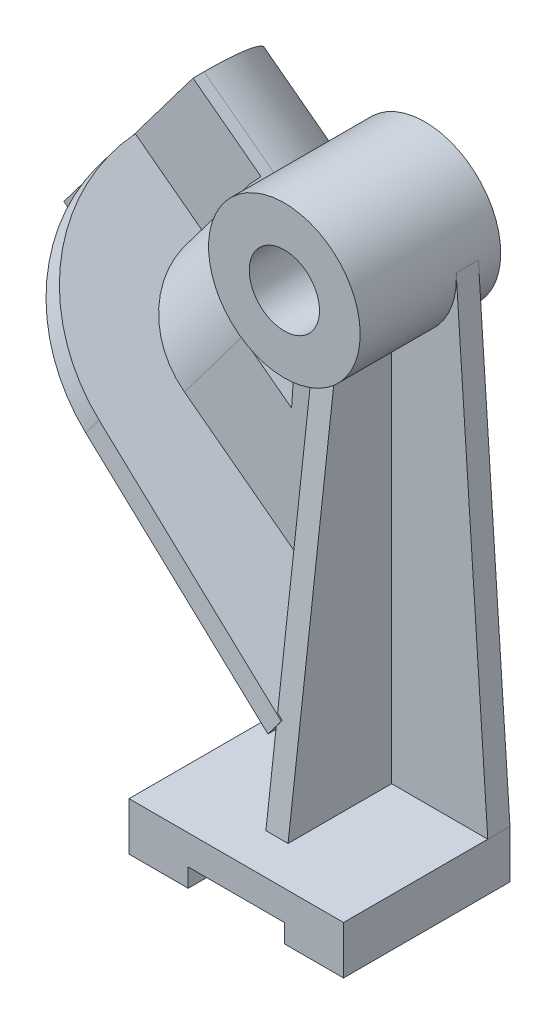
ISO-10303-21;
HEADER;
FILE_DESCRIPTION(('STEP AP214'),'2;1');
FILE_NAME('part.step','',(''),(''),'','','');
FILE_SCHEMA(('AUTOMOTIVE_DESIGN { 1 0 10303 214 1 1 1 1 }'));
ENDSEC;
DATA;
#1=APPLICATION_CONTEXT('core data for automotive mechanical design processes');
#2=APPLICATION_PROTOCOL_DEFINITION('international standard','automotive_design',2000,#1);
#3=PRODUCT_CONTEXT('',#1,'mechanical');
#4=PRODUCT('Part','Part','',(#3));
#5=PRODUCT_RELATED_PRODUCT_CATEGORY('part','',(#4));
#6=PRODUCT_DEFINITION_FORMATION('','',#4);
#7=PRODUCT_DEFINITION_CONTEXT('part definition',#1,'design');
#8=PRODUCT_DEFINITION('design','',#6,#7);
#9=PRODUCT_DEFINITION_SHAPE('','',#8);
#10=(LENGTH_UNIT() NAMED_UNIT(*) SI_UNIT(.MILLI.,.METRE.));
#11=(NAMED_UNIT(*) PLANE_ANGLE_UNIT() SI_UNIT($,.RADIAN.));
#12=(NAMED_UNIT(*) SI_UNIT($,.STERADIAN.) SOLID_ANGLE_UNIT());
#13=UNCERTAINTY_MEASURE_WITH_UNIT(LENGTH_MEASURE(1.E-05),#10,'distance_accuracy_value','');
#14=(GEOMETRIC_REPRESENTATION_CONTEXT(3) GLOBAL_UNCERTAINTY_ASSIGNED_CONTEXT((#13)) GLOBAL_UNIT_ASSIGNED_CONTEXT((#10,
#11,#12)) REPRESENTATION_CONTEXT('',''));
#15=CARTESIAN_POINT('',(0.,0.,0.));
#16=DIRECTION('',(0.,0.,1.));
#17=DIRECTION('',(1.,0.,0.));
#18=AXIS2_PLACEMENT_3D('',#15,#16,#17);
#19=CARTESIAN_POINT('',(0.,140.,6.));
#20=DIRECTION('',(0.,0.,1.));
#21=DIRECTION('',(1.,0.,0.));
#22=AXIS2_PLACEMENT_3D('',#19,#20,#21);
#23=PLANE('',#22);
#24=DIRECTION('',(-0.798635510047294,0.601815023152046,0.));
#25=VECTOR('',#24,1.);
#26=CARTESIAN_POINT('',(-49.6220556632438,74.1493079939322,6.));
#27=LINE('',#26,#25);
#28=CARTESIAN_POINT('',(-3.,39.0170691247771,6.));
#29=VERTEX_POINT('',#28);
#30=CARTESIAN_POINT('',(-53.0204802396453,76.7102045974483,5.99999999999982));
#31=VERTEX_POINT('',#30);
#32=EDGE_CURVE('E287',#29,#31,#27,.T.);
#33=ORIENTED_EDGE('',*,*,#32,.F.);
#34=DIRECTION('',(0.,1.,0.));
#35=VECTOR('',#34,1.);
#36=CARTESIAN_POINT('',(-3.,140.,6.));
#37=LINE('',#36,#35);
#38=CARTESIAN_POINT('',(-3.,119.720700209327,6.));
#39=VERTEX_POINT('',#38);
#40=EDGE_CURVE('E366',#29,#39,#37,.T.);
#41=ORIENTED_EDGE('',*,*,#40,.T.);
#42=CARTESIAN_POINT('',(0.,140.,6.));
#43=DIRECTION('',(0.,0.,-1.));
#44=DIRECTION('',(1.,0.,0.));
#45=AXIS2_PLACEMENT_3D('',#42,#43,#44);
#46=CIRCLE('',#45,20.5);
#47=CARTESIAN_POINT('',(-20.4547243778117,141.361708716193,6.));
#48=VERTEX_POINT('',#47);
#49=EDGE_CURVE('E443',#39,#48,#46,.T.);
#50=ORIENTED_EDGE('',*,*,#49,.T.);
#51=DIRECTION('',(-0.0664248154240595,-0.997791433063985,0.));
#52=VECTOR('',#51,1.);
#53=CARTESIAN_POINT('',(-29.,13.,6.));
#54=LINE('',#53,#52);
#55=CARTESIAN_POINT('',(-24.0449825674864,87.4311280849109,6.));
#56=VERTEX_POINT('',#55);
#57=EDGE_CURVE('E418',#48,#56,#54,.T.);
#58=ORIENTED_EDGE('',*,*,#57,.T.);
#59=DIRECTION('',(-0.798635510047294,0.601815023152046,0.));
#60=VECTOR('',#59,1.);
#61=CARTESIAN_POINT('',(17.4526356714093,56.1604297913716,5.9999999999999));
#62=LINE('',#61,#60);
#63=CARTESIAN_POINT('',(-37.373289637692,97.474727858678,5.99999999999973));
#64=VERTEX_POINT('',#63);
#65=EDGE_CURVE('E324',#56,#64,#62,.T.);
#66=ORIENTED_EDGE('',*,*,#65,.T.);
#67=DIRECTION('',(-0.601815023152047,-0.798635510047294,0.));
#68=VECTOR('',#67,1.);
#69=CARTESIAN_POINT('',(-37.373289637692,97.474727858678,5.99999999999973));
#70=LINE('',#69,#68);
#71=EDGE_CURVE('E347',#64,#31,#70,.T.);
#72=ORIENTED_EDGE('',*,*,#71,.T.);
#73=EDGE_LOOP('',(#33,#41,#50,#58,#66,#72));
#74=FACE_BOUND('',#73,.T.);
#75=ADVANCED_FACE('F33',(#74),#23,.T.);
#76=CARTESIAN_POINT('',(-3.,80.25,19.5000125));
#77=DIRECTION('',(1.,0.,0.));
#78=DIRECTION('',(0.,0.,-1.));
#79=AXIS2_PLACEMENT_3D('',#76,#77,#78);
#80=PLANE('',#79);
#81=DIRECTION('',(0.,-0.99263221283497,0.121166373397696));
#82=VECTOR('',#81,1.);
#83=CARTESIAN_POINT('',(-3.,119.5,21.));
#84=LINE('',#83,#82);
#85=CARTESIAN_POINT('',(-3.,36.0791819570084,31.1828228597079));
#86=VERTEX_POINT('',#85);
#87=CARTESIAN_POINT('',(-3.,13.,34.));
#88=VERTEX_POINT('',#87);
#89=EDGE_CURVE('E356',#86,#88,#84,.T.);
#90=ORIENTED_EDGE('',*,*,#89,.F.);
#91=DIRECTION('',(0.,0.,1.));
#92=VECTOR('',#91,1.);
#93=CARTESIAN_POINT('',(-3.,36.0791819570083,19.5000125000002));
#94=LINE('',#93,#92);
#95=CARTESIAN_POINT('',(-3.,36.0791819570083,6.));
#96=VERTEX_POINT('',#95);
#97=EDGE_CURVE('E11',#86,#96,#94,.F.);
#98=ORIENTED_EDGE('',*,*,#97,.T.);
#99=CARTESIAN_POINT('',(-3.,13.,6.));
#100=VERTEX_POINT('',#99);
#101=EDGE_CURVE('E367',#100,#96,#37,.T.);
#102=ORIENTED_EDGE('',*,*,#101,.F.);
#103=DIRECTION('',(0.,0.,1.));
#104=VECTOR('',#103,1.);
#105=CARTESIAN_POINT('',(-3.,13.,45.));
#106=LINE('',#105,#104);
#107=EDGE_CURVE('E370',#100,#88,#106,.T.);
#108=ORIENTED_EDGE('',*,*,#107,.T.);
#109=EDGE_LOOP('',(#90,#98,#102,#108));
#110=FACE_BOUND('',#109,.T.);
#111=ADVANCED_FACE('F534',(#110),#80,.F.);
#112=CARTESIAN_POINT('',(-37.373289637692,97.4747278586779,-19.0000000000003));
#113=DIRECTION('',(-0.601815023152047,-0.798635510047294,0.));
#114=DIRECTION('',(0.798635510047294,-0.601815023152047,0.));
#115=AXIS2_PLACEMENT_3D('',#112,#113,#114);
#116=CYLINDRICAL_SURFACE('',#115,25.);
#117=CARTESIAN_POINT('',(-56.6313703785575,71.9183915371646,5.99999999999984));
#118=VERTEX_POINT('',#117);
#119=CARTESIAN_POINT('',(-72.2785609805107,51.1538682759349,5.99999999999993));
#120=VERTEX_POINT('',#119);
#121=EDGE_CURVE('E346',#118,#120,#70,.T.);
#122=ORIENTED_EDGE('',*,*,#121,.F.);
#123=CARTESIAN_POINT('',(-56.6313703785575,71.9183915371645,-19.0000000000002));
#124=DIRECTION('',(0.601815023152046,0.798635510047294,0.));
#125=DIRECTION('',(-0.798635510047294,0.601815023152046,0.));
#126=AXIS2_PLACEMENT_3D('',#123,#124,#125);
#127=CIRCLE('',#126,25.);
#128=CARTESIAN_POINT('',(-76.5972581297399,86.9637671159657,-19.0000000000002));
#129=VERTEX_POINT('',#128);
#130=EDGE_CURVE('E277',#118,#129,#127,.F.);
#131=ORIENTED_EDGE('',*,*,#130,.T.);
#132=DIRECTION('',(-0.601815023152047,-0.798635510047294,0.));
#133=VECTOR('',#132,1.);
#134=CARTESIAN_POINT('',(-57.3391773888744,112.520103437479,-19.0000000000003));
#135=LINE('',#134,#133);
#136=CARTESIAN_POINT('',(-92.2444487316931,66.199243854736,-19.0000000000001));
#137=VERTEX_POINT('',#136);
#138=EDGE_CURVE('E350',#129,#137,#135,.T.);
#139=ORIENTED_EDGE('',*,*,#138,.T.);
#140=CARTESIAN_POINT('',(-72.2785609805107,51.1538682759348,-19.0000000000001));
#141=DIRECTION('',(0.601815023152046,0.798635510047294,0.));
#142=DIRECTION('',(-0.798635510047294,0.601815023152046,0.));
#143=AXIS2_PLACEMENT_3D('',#140,#141,#142);
#144=CIRCLE('',#143,25.);
#145=EDGE_CURVE('E332',#120,#137,#144,.F.);
#146=ORIENTED_EDGE('',*,*,#145,.F.);
#147=EDGE_LOOP('',(#122,#131,#139,#146));
#148=FACE_BOUND('',#147,.T.);
#149=ADVANCED_FACE('F624',(#148),#116,.T.);
#150=CARTESIAN_POINT('',(-74.7918130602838,89.3596736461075,-21.9999999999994));
#151=DIRECTION('',(0.798635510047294,-0.601815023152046,0.));
#152=DIRECTION('',(0.601815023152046,0.798635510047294,0.));
#153=AXIS2_PLACEMENT_3D('',#150,#151,#152);
#154=CYLINDRICAL_SURFACE('',#153,29.);
#155=DIRECTION('',(0.798635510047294,-0.601815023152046,0.));
#156=VECTOR('',#155,1.);
#157=CARTESIAN_POINT('',(-37.373289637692,97.4747278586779,-21.9999999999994));
#158=LINE('',#157,#156);
#159=CARTESIAN_POINT('',(-52.5473643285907,108.909213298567,-21.9999999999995));
#160=VERTEX_POINT('',#159);
#161=CARTESIAN_POINT('',(-75.7077941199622,126.361848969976,-21.9999999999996));
#162=VERTEX_POINT('',#161);
#163=EDGE_CURVE('E506',#160,#162,#158,.F.);
#164=ORIENTED_EDGE('',*,*,#163,.F.);
#165=CARTESIAN_POINT('',(-70.,85.7487835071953,-21.9999999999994));
#166=DIRECTION('',(-0.798635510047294,0.601815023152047,0.));
#167=DIRECTION('',(-0.601815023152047,-0.798635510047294,0.));
#168=AXIS2_PLACEMENT_3D('',#165,#166,#167);
#169=CIRCLE('',#168,29.);
#170=CARTESIAN_POINT('',(-87.4526356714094,62.5883537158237,-21.9999999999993));
#171=VERTEX_POINT('',#170);
#172=EDGE_CURVE('E41',#171,#160,#169,.F.);
#173=ORIENTED_EDGE('',*,*,#172,.F.);
#174=DIRECTION('',(-0.798635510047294,0.601815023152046,0.));
#175=VECTOR('',#174,1.);
#176=CARTESIAN_POINT('',(-92.2444487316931,66.199243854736,-21.9999999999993));
#177=LINE('',#176,#175);
#178=CARTESIAN_POINT('',(-110.613065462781,80.0409893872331,-21.9999999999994));
#179=VERTEX_POINT('',#178);
#180=EDGE_CURVE('E501',#179,#171,#177,.F.);
#181=ORIENTED_EDGE('',*,*,#180,.F.);
#182=CARTESIAN_POINT('',(-93.1604297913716,103.201419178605,-21.9999999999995));
#183=DIRECTION('',(0.798635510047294,-0.601815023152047,0.));
#184=DIRECTION('',(0.601815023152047,0.798635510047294,0.));
#185=AXIS2_PLACEMENT_3D('',#182,#183,#184);
#186=CIRCLE('',#185,29.);
#187=EDGE_CURVE('E305',#179,#162,#186,.T.);
#188=ORIENTED_EDGE('',*,*,#187,.T.);
#189=EDGE_LOOP('',(#164,#173,#181,#188));
#190=FACE_BOUND('',#189,.T.);
#191=ADVANCED_FACE('F35',(#190),#154,.T.);
#192=CARTESIAN_POINT('',(-29.,13.,6.));
#193=DIRECTION('',(0.997791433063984,-0.0664248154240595,0.));
#194=DIRECTION('',(0.0664248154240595,0.997791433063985,0.));
#195=AXIS2_PLACEMENT_3D('',#192,#193,#194);
#196=PLANE('',#195);
#197=DIRECTION('',(0.,0.,1.));
#198=VECTOR('',#197,1.);
#199=CARTESIAN_POINT('',(-28.6487377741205,18.2764382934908,5.99999999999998));
#200=LINE('',#199,#198);
#201=CARTESIAN_POINT('',(-28.6487377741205,18.2764382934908,0.));
#202=VERTEX_POINT('',#201);
#203=CARTESIAN_POINT('',(-28.6487377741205,18.2764382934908,6.00000000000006));
#204=VERTEX_POINT('',#203);
#205=EDGE_CURVE('E419',#202,#204,#200,.T.);
#206=ORIENTED_EDGE('',*,*,#205,.F.);
#207=DIRECTION('',(-0.0664248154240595,-0.997791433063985,0.));
#208=VECTOR('',#207,1.);
#209=CARTESIAN_POINT('',(-29.,13.,0.));
#210=LINE('',#209,#208);
#211=CARTESIAN_POINT('',(-29.,13.,0.));
#212=VERTEX_POINT('',#211);
#213=EDGE_CURVE('E604',#202,#212,#210,.T.);
#214=ORIENTED_EDGE('',*,*,#213,.T.);
#215=DIRECTION('',(0.,0.,-1.));
#216=VECTOR('',#215,1.);
#217=CARTESIAN_POINT('',(-29.,13.,6.));
#218=LINE('',#217,#216);
#219=CARTESIAN_POINT('',(-29.,13.,6.00000000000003));
#220=VERTEX_POINT('',#219);
#221=EDGE_CURVE('E424',#220,#212,#218,.T.);
#222=ORIENTED_EDGE('',*,*,#221,.F.);
#223=EDGE_CURVE('E415',#204,#220,#54,.T.);
#224=ORIENTED_EDGE('',*,*,#223,.F.);
#225=EDGE_LOOP('',(#206,#214,#222,#224));
#226=FACE_BOUND('',#225,.T.);
#227=ADVANCED_FACE('F608',(#226),#196,.F.);
#228=DIRECTION('',(-0.601815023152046,-0.798635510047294,0.));
#229=VECTOR('',#228,1.);
#230=CARTESIAN_POINT('',(48.0340948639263,103.803713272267,6.));
#231=LINE('',#230,#229);
#232=CARTESIAN_POINT('',(-5.19885093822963,33.161208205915,6.));
#233=VERTEX_POINT('',#232);
#234=EDGE_CURVE('E297',#233,#96,#231,.F.);
#235=ORIENTED_EDGE('',*,*,#234,.F.);
#236=DIRECTION('',(-0.798635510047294,0.601815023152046,0.));
#237=VECTOR('',#236,1.);
#238=CARTESIAN_POINT('',(-53.2329458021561,69.3574949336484,6.));
#239=LINE('',#238,#237);
#240=EDGE_CURVE('E280',#233,#118,#239,.T.);
#241=ORIENTED_EDGE('',*,*,#240,.T.);
#242=ORIENTED_EDGE('',*,*,#121,.T.);
#243=DIRECTION('',(-0.798635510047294,0.601815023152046,0.));
#244=VECTOR('',#243,1.);
#245=CARTESIAN_POINT('',(-17.4526356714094,9.8395702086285,6.0000000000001));
#246=LINE('',#245,#244);
#247=EDGE_CURVE('E335',#204,#120,#246,.T.);
#248=ORIENTED_EDGE('',*,*,#247,.F.);
#249=ORIENTED_EDGE('',*,*,#223,.T.);
#250=DIRECTION('',(1.,0.,0.));
#251=VECTOR('',#250,1.);
#252=CARTESIAN_POINT('',(29.,13.,6.));
#253=LINE('',#252,#251);
#254=EDGE_CURVE('E405',#220,#100,#253,.T.);
#255=ORIENTED_EDGE('',*,*,#254,.T.);
#256=ORIENTED_EDGE('',*,*,#101,.T.);
#257=EDGE_LOOP('',(#235,#241,#242,#248,#249,#255,#256));
#258=FACE_BOUND('',#257,.T.);
#259=ADVANCED_FACE('F527',(#258),#23,.T.);
#260=CARTESIAN_POINT('',(-29.,13.,45.));
#261=DIRECTION('',(0.,-1.,0.));
#262=DIRECTION('',(0.,0.,-1.));
#263=AXIS2_PLACEMENT_3D('',#260,#261,#262);
#264=PLANE('',#263);
#265=CARTESIAN_POINT('',(3.,13.,6.));
#266=VERTEX_POINT('',#265);
#267=CARTESIAN_POINT('',(29.,13.,6.));
#268=VERTEX_POINT('',#267);
#269=EDGE_CURVE('E409',#266,#268,#253,.T.);
#270=ORIENTED_EDGE('',*,*,#269,.F.);
#271=DIRECTION('',(0.,0.,1.));
#272=VECTOR('',#271,1.);
#273=CARTESIAN_POINT('',(3.,13.,45.));
#274=LINE('',#273,#272);
#275=CARTESIAN_POINT('',(3.,13.,34.));
#276=VERTEX_POINT('',#275);
#277=EDGE_CURVE('E377',#266,#276,#274,.T.);
#278=ORIENTED_EDGE('',*,*,#277,.T.);
#279=DIRECTION('',(-1.,0.,0.));
#280=VECTOR('',#279,1.);
#281=CARTESIAN_POINT('',(-29.,13.,34.));
#282=LINE('',#281,#280);
#283=EDGE_CURVE('E383',#276,#88,#282,.T.);
#284=ORIENTED_EDGE('',*,*,#283,.T.);
#285=ORIENTED_EDGE('',*,*,#107,.F.);
#286=ORIENTED_EDGE('',*,*,#254,.F.);
#287=DIRECTION('',(0.,0.,-1.));
#288=VECTOR('',#287,1.);
#289=CARTESIAN_POINT('',(-29.,13.,45.));
#290=LINE('',#289,#288);
#291=CARTESIAN_POINT('',(-29.,13.,45.));
#292=VERTEX_POINT('',#291);
#293=EDGE_CURVE('E476',#292,#220,#290,.T.);
#294=ORIENTED_EDGE('',*,*,#293,.F.);
#295=DIRECTION('',(-1.,0.,0.));
#296=VECTOR('',#295,1.);
#297=CARTESIAN_POINT('',(-29.,13.,45.));
#298=LINE('',#297,#296);
#299=CARTESIAN_POINT('',(29.,13.,45.));
#300=VERTEX_POINT('',#299);
#301=EDGE_CURVE('E550',#300,#292,#298,.T.);
#302=ORIENTED_EDGE('',*,*,#301,.F.);
#303=DIRECTION('',(0.,0.,-1.));
#304=VECTOR('',#303,1.);
#305=CARTESIAN_POINT('',(29.,13.,45.));
#306=LINE('',#305,#304);
#307=EDGE_CURVE('E470',#300,#268,#306,.T.);
#308=ORIENTED_EDGE('',*,*,#307,.T.);
#309=EDGE_LOOP('',(#270,#278,#284,#285,#286,#294,#302,#308));
#310=FACE_BOUND('',#309,.T.);
#311=ADVANCED_FACE('F537',(#310),#264,.F.);
#312=CARTESIAN_POINT('',(-29.,0.,45.));
#313=DIRECTION('',(1.,0.,0.));
#314=DIRECTION('',(0.,0.,-1.));
#315=AXIS2_PLACEMENT_3D('',#312,#313,#314);
#316=PLANE('',#315);
#317=DIRECTION('',(0.,-1.,0.));
#318=VECTOR('',#317,1.);
#319=CARTESIAN_POINT('',(-29.,0.,0.));
#320=LINE('',#319,#318);
#321=CARTESIAN_POINT('',(-29.,0.,0.));
#322=VERTEX_POINT('',#321);
#323=EDGE_CURVE('E561',#212,#322,#320,.T.);
#324=ORIENTED_EDGE('',*,*,#323,.T.);
#325=DIRECTION('',(0.,0.,-1.));
#326=VECTOR('',#325,1.);
#327=CARTESIAN_POINT('',(-29.,0.,45.));
#328=LINE('',#327,#326);
#329=CARTESIAN_POINT('',(-29.,0.,45.));
#330=VERTEX_POINT('',#329);
#331=EDGE_CURVE('E496',#330,#322,#328,.T.);
#332=ORIENTED_EDGE('',*,*,#331,.F.);
#333=DIRECTION('',(0.,-1.,0.));
#334=VECTOR('',#333,1.);
#335=CARTESIAN_POINT('',(-29.,0.,45.));
#336=LINE('',#335,#334);
#337=EDGE_CURVE('E567',#292,#330,#336,.T.);
#338=ORIENTED_EDGE('',*,*,#337,.F.);
#339=ORIENTED_EDGE('',*,*,#293,.T.);
#340=ORIENTED_EDGE('',*,*,#221,.T.);
#341=EDGE_LOOP('',(#324,#332,#338,#339,#340));
#342=FACE_BOUND('',#341,.T.);
#343=ADVANCED_FACE('F829',(#342),#316,.F.);
#344=CARTESIAN_POINT('',(-29.,0.,45.));
#345=DIRECTION('',(0.,1.,0.));
#346=DIRECTION('',(0.,0.,1.));
#347=AXIS2_PLACEMENT_3D('',#344,#345,#346);
#348=PLANE('',#347);
#349=DIRECTION('',(1.,0.,0.));
#350=VECTOR('',#349,1.);
#351=CARTESIAN_POINT('',(-29.,0.,0.));
#352=LINE('',#351,#350);
#353=CARTESIAN_POINT('',(-13.,0.,0.));
#354=VERTEX_POINT('',#353);
#355=EDGE_CURVE('E584',#322,#354,#352,.T.);
#356=ORIENTED_EDGE('',*,*,#355,.T.);
#357=DIRECTION('',(0.,0.,-1.));
#358=VECTOR('',#357,1.);
#359=CARTESIAN_POINT('',(-13.,0.,45.));
#360=LINE('',#359,#358);
#361=CARTESIAN_POINT('',(-13.,0.,45.));
#362=VERTEX_POINT('',#361);
#363=EDGE_CURVE('E494',#362,#354,#360,.T.);
#364=ORIENTED_EDGE('',*,*,#363,.F.);
#365=DIRECTION('',(1.,0.,0.));
#366=VECTOR('',#365,1.);
#367=CARTESIAN_POINT('',(-29.,0.,45.));
#368=LINE('',#367,#366);
#369=EDGE_CURVE('E570',#330,#362,#368,.T.);
#370=ORIENTED_EDGE('',*,*,#369,.F.);
#371=ORIENTED_EDGE('',*,*,#331,.T.);
#372=EDGE_LOOP('',(#356,#364,#370,#371));
#373=FACE_BOUND('',#372,.T.);
#374=ADVANCED_FACE('F908',(#373),#348,.F.);
#375=CARTESIAN_POINT('',(-13.,0.,45.));
#376=DIRECTION('',(-1.,0.,0.));
#377=DIRECTION('',(0.,0.,1.));
#378=AXIS2_PLACEMENT_3D('',#375,#376,#377);
#379=PLANE('',#378);
#380=DIRECTION('',(0.,1.,0.));
#381=VECTOR('',#380,1.);
#382=CARTESIAN_POINT('',(-13.,0.,0.));
#383=LINE('',#382,#381);
#384=CARTESIAN_POINT('',(-13.,5.,0.));
#385=VERTEX_POINT('',#384);
#386=EDGE_CURVE('E586',#354,#385,#383,.T.);
#387=ORIENTED_EDGE('',*,*,#386,.T.);
#388=DIRECTION('',(0.,0.,-1.));
#389=VECTOR('',#388,1.);
#390=CARTESIAN_POINT('',(-13.,5.,45.));
#391=LINE('',#390,#389);
#392=CARTESIAN_POINT('',(-13.,5.,45.));
#393=VERTEX_POINT('',#392);
#394=EDGE_CURVE('E491',#393,#385,#391,.T.);
#395=ORIENTED_EDGE('',*,*,#394,.F.);
#396=DIRECTION('',(0.,1.,0.));
#397=VECTOR('',#396,1.);
#398=CARTESIAN_POINT('',(-13.,0.,45.));
#399=LINE('',#398,#397);
#400=EDGE_CURVE('E572',#362,#393,#399,.T.);
#401=ORIENTED_EDGE('',*,*,#400,.F.);
#402=ORIENTED_EDGE('',*,*,#363,.T.);
#403=EDGE_LOOP('',(#387,#395,#401,#402));
#404=FACE_BOUND('',#403,.T.);
#405=ADVANCED_FACE('F872',(#404),#379,.F.);
#406=CARTESIAN_POINT('',(-13.,5.,45.));
#407=DIRECTION('',(0.,1.,0.));
#408=DIRECTION('',(0.,0.,1.));
#409=AXIS2_PLACEMENT_3D('',#406,#407,#408);
#410=PLANE('',#409);
#411=DIRECTION('',(1.,0.,0.));
#412=VECTOR('',#411,1.);
#413=CARTESIAN_POINT('',(-13.,5.,0.));
#414=LINE('',#413,#412);
#415=CARTESIAN_POINT('',(13.,5.,0.));
#416=VERTEX_POINT('',#415);
#417=EDGE_CURVE('E588',#385,#416,#414,.T.);
#418=ORIENTED_EDGE('',*,*,#417,.T.);
#419=DIRECTION('',(0.,0.,-1.));
#420=VECTOR('',#419,1.);
#421=CARTESIAN_POINT('',(13.,5.,45.));
#422=LINE('',#421,#420);
#423=CARTESIAN_POINT('',(13.,5.,45.));
#424=VERTEX_POINT('',#423);
#425=EDGE_CURVE('E488',#424,#416,#422,.T.);
#426=ORIENTED_EDGE('',*,*,#425,.F.);
#427=DIRECTION('',(1.,0.,0.));
#428=VECTOR('',#427,1.);
#429=CARTESIAN_POINT('',(-13.,5.,45.));
#430=LINE('',#429,#428);
#431=EDGE_CURVE('E574',#393,#424,#430,.T.);
#432=ORIENTED_EDGE('',*,*,#431,.F.);
#433=ORIENTED_EDGE('',*,*,#394,.T.);
#434=EDGE_LOOP('',(#418,#426,#432,#433));
#435=FACE_BOUND('',#434,.T.);
#436=ADVANCED_FACE('F866',(#435),#410,.F.);
#437=CARTESIAN_POINT('',(13.,0.,45.));
#438=DIRECTION('',(1.,0.,0.));
#439=DIRECTION('',(0.,0.,-1.));
#440=AXIS2_PLACEMENT_3D('',#437,#438,#439);
#441=PLANE('',#440);
#442=DIRECTION('',(0.,-1.,0.));
#443=VECTOR('',#442,1.);
#444=CARTESIAN_POINT('',(13.,0.,0.));
#445=LINE('',#444,#443);
#446=CARTESIAN_POINT('',(13.,0.,0.));
#447=VERTEX_POINT('',#446);
#448=EDGE_CURVE('E590',#416,#447,#445,.T.);
#449=ORIENTED_EDGE('',*,*,#448,.T.);
#450=DIRECTION('',(0.,0.,-1.));
#451=VECTOR('',#450,1.);
#452=CARTESIAN_POINT('',(13.,0.,45.));
#453=LINE('',#452,#451);
#454=CARTESIAN_POINT('',(13.,0.,45.));
#455=VERTEX_POINT('',#454);
#456=EDGE_CURVE('E485',#455,#447,#453,.T.);
#457=ORIENTED_EDGE('',*,*,#456,.F.);
#458=DIRECTION('',(0.,-1.,0.));
#459=VECTOR('',#458,1.);
#460=CARTESIAN_POINT('',(13.,0.,45.));
#461=LINE('',#460,#459);
#462=EDGE_CURVE('E576',#424,#455,#461,.T.);
#463=ORIENTED_EDGE('',*,*,#462,.F.);
#464=ORIENTED_EDGE('',*,*,#425,.T.);
#465=EDGE_LOOP('',(#449,#457,#463,#464));
#466=FACE_BOUND('',#465,.T.);
#467=ADVANCED_FACE('F871',(#466),#441,.F.);
#468=CARTESIAN_POINT('',(13.,0.,45.));
#469=DIRECTION('',(0.,1.,0.));
#470=DIRECTION('',(0.,0.,1.));
#471=AXIS2_PLACEMENT_3D('',#468,#469,#470);
#472=PLANE('',#471);
#473=DIRECTION('',(1.,0.,0.));
#474=VECTOR('',#473,1.);
#475=CARTESIAN_POINT('',(13.,0.,0.));
#476=LINE('',#475,#474);
#477=CARTESIAN_POINT('',(29.,0.,0.));
#478=VERTEX_POINT('',#477);
#479=EDGE_CURVE('E592',#447,#478,#476,.T.);
#480=ORIENTED_EDGE('',*,*,#479,.T.);
#481=DIRECTION('',(0.,0.,-1.));
#482=VECTOR('',#481,1.);
#483=CARTESIAN_POINT('',(29.,0.,45.));
#484=LINE('',#483,#482);
#485=CARTESIAN_POINT('',(29.,0.,45.));
#486=VERTEX_POINT('',#485);
#487=EDGE_CURVE('E475',#486,#478,#484,.T.);
#488=ORIENTED_EDGE('',*,*,#487,.F.);
#489=DIRECTION('',(1.,0.,0.));
#490=VECTOR('',#489,1.);
#491=CARTESIAN_POINT('',(13.,0.,45.));
#492=LINE('',#491,#490);
#493=EDGE_CURVE('E578',#455,#486,#492,.T.);
#494=ORIENTED_EDGE('',*,*,#493,.F.);
#495=ORIENTED_EDGE('',*,*,#456,.T.);
#496=EDGE_LOOP('',(#480,#488,#494,#495));
#497=FACE_BOUND('',#496,.T.);
#498=ADVANCED_FACE('F596',(#497),#472,.F.);
#499=CARTESIAN_POINT('',(29.,0.,45.));
#500=DIRECTION('',(-1.,0.,0.));
#501=DIRECTION('',(0.,0.,1.));
#502=AXIS2_PLACEMENT_3D('',#499,#500,#501);
#503=PLANE('',#502);
#504=DIRECTION('',(0.,1.,0.));
#505=VECTOR('',#504,1.);
#506=CARTESIAN_POINT('',(29.,0.,0.));
#507=LINE('',#506,#505);
#508=CARTESIAN_POINT('',(29.,13.,0.));
#509=VERTEX_POINT('',#508);
#510=EDGE_CURVE('E557',#478,#509,#507,.T.);
#511=ORIENTED_EDGE('',*,*,#510,.T.);
#512=DIRECTION('',(0.,0.,-1.));
#513=VECTOR('',#512,1.);
#514=CARTESIAN_POINT('',(29.,13.,6.));
#515=LINE('',#514,#513);
#516=EDGE_CURVE('E554',#268,#509,#515,.T.);
#517=ORIENTED_EDGE('',*,*,#516,.F.);
#518=ORIENTED_EDGE('',*,*,#307,.F.);
#519=DIRECTION('',(0.,1.,0.));
#520=VECTOR('',#519,1.);
#521=CARTESIAN_POINT('',(29.,0.,45.));
#522=LINE('',#521,#520);
#523=EDGE_CURVE('E580',#486,#300,#522,.T.);
#524=ORIENTED_EDGE('',*,*,#523,.F.);
#525=ORIENTED_EDGE('',*,*,#487,.T.);
#526=EDGE_LOOP('',(#511,#517,#518,#524,#525));
#527=FACE_BOUND('',#526,.T.);
#528=ADVANCED_FACE('F555',(#527),#503,.F.);
#529=CARTESIAN_POINT('',(-29.,13.,45.));
#530=DIRECTION('',(0.,0.,-1.));
#531=DIRECTION('',(-1.,0.,0.));
#532=AXIS2_PLACEMENT_3D('',#529,#530,#531);
#533=PLANE('',#532);
#534=ORIENTED_EDGE('',*,*,#337,.T.);
#535=ORIENTED_EDGE('',*,*,#369,.T.);
#536=ORIENTED_EDGE('',*,*,#400,.T.);
#537=ORIENTED_EDGE('',*,*,#431,.T.);
#538=ORIENTED_EDGE('',*,*,#462,.T.);
#539=ORIENTED_EDGE('',*,*,#493,.T.);
#540=ORIENTED_EDGE('',*,*,#523,.T.);
#541=ORIENTED_EDGE('',*,*,#301,.T.);
#542=EDGE_LOOP('',(#534,#535,#536,#537,#538,#539,#540,#541));
#543=FACE_BOUND('',#542,.T.);
#544=ADVANCED_FACE('F747',(#543),#533,.F.);
#545=CARTESIAN_POINT('',(-29.,13.,0.));
#546=DIRECTION('',(0.,0.,-1.));
#547=DIRECTION('',(-1.,0.,0.));
#548=AXIS2_PLACEMENT_3D('',#545,#546,#547);
#549=PLANE('',#548);
#550=DIRECTION('',(-0.798635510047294,0.601815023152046,0.));
#551=VECTOR('',#550,1.);
#552=CARTESIAN_POINT('',(-17.4526356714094,9.83957020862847,1.01253017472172E-13));
#553=LINE('',#552,#551);
#554=CARTESIAN_POINT('',(-72.2785609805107,51.1538682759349,0.));
#555=VERTEX_POINT('',#554);
#556=EDGE_CURVE('E338',#202,#555,#553,.T.);
#557=ORIENTED_EDGE('',*,*,#556,.T.);
#558=DIRECTION('',(-0.601815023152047,-0.798635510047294,0.));
#559=VECTOR('',#558,1.);
#560=CARTESIAN_POINT('',(-37.373289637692,97.474727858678,-2.80424297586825E-13));
#561=LINE('',#560,#559);
#562=CARTESIAN_POINT('',(-37.373289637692,97.474727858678,-2.80424297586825E-13));
#563=VERTEX_POINT('',#562);
#564=EDGE_CURVE('E344',#563,#555,#561,.T.);
#565=ORIENTED_EDGE('',*,*,#564,.F.);
#566=DIRECTION('',(-0.798635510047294,0.601815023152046,0.));
#567=VECTOR('',#566,1.);
#568=CARTESIAN_POINT('',(17.4526356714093,56.1604297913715,-1.01253017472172E-13));
#569=LINE('',#568,#567);
#570=CARTESIAN_POINT('',(-24.0449825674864,87.4311280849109,0.));
#571=VERTEX_POINT('',#570);
#572=EDGE_CURVE('E326',#571,#563,#569,.T.);
#573=ORIENTED_EDGE('',*,*,#572,.F.);
#574=CARTESIAN_POINT('',(-20.4547243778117,141.361708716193,0.));
#575=VERTEX_POINT('',#574);
#576=EDGE_CURVE('E412',#575,#571,#210,.T.);
#577=ORIENTED_EDGE('',*,*,#576,.F.);
#578=CARTESIAN_POINT('',(0.,140.,0.));
#579=DIRECTION('',(0.,0.,-1.));
#580=DIRECTION('',(1.,0.,0.));
#581=AXIS2_PLACEMENT_3D('',#578,#579,#580);
#582=CIRCLE('',#581,20.5);
#583=CARTESIAN_POINT('',(20.4547243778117,141.361708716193,0.));
#584=VERTEX_POINT('',#583);
#585=EDGE_CURVE('E603',#584,#575,#582,.T.);
#586=ORIENTED_EDGE('',*,*,#585,.F.);
#587=DIRECTION('',(-0.0664248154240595,0.997791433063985,0.));
#588=VECTOR('',#587,1.);
#589=CARTESIAN_POINT('',(20.4547243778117,141.361708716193,0.));
#590=LINE('',#589,#588);
#591=EDGE_CURVE('E398',#509,#584,#590,.T.);
#592=ORIENTED_EDGE('',*,*,#591,.F.);
#593=ORIENTED_EDGE('',*,*,#510,.F.);
#594=ORIENTED_EDGE('',*,*,#479,.F.);
#595=ORIENTED_EDGE('',*,*,#448,.F.);
#596=ORIENTED_EDGE('',*,*,#417,.F.);
#597=ORIENTED_EDGE('',*,*,#386,.F.);
#598=ORIENTED_EDGE('',*,*,#355,.F.);
#599=ORIENTED_EDGE('',*,*,#323,.F.);
#600=ORIENTED_EDGE('',*,*,#213,.F.);
#601=EDGE_LOOP('',(#557,#565,#573,#577,#586,#592,#593,#594,#595,#596,#597,#598,#599,#600));
#602=FACE_BOUND('',#601,.T.);
#603=ADVANCED_FACE('F601',(#602),#549,.T.);
#604=CARTESIAN_POINT('',(20.4547243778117,141.361708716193,6.));
#605=DIRECTION('',(-0.997791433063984,-0.0664248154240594,0.));
#606=DIRECTION('',(0.0664248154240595,-0.997791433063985,0.));
#607=AXIS2_PLACEMENT_3D('',#604,#605,#606);
#608=PLANE('',#607);
#609=ORIENTED_EDGE('',*,*,#591,.T.);
#610=DIRECTION('',(0.,0.,-1.));
#611=VECTOR('',#610,1.);
#612=CARTESIAN_POINT('',(20.4547243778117,141.361708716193,6.));
#613=LINE('',#612,#611);
#614=CARTESIAN_POINT('',(20.4547243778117,141.361708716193,6.));
#615=VERTEX_POINT('',#614);
#616=EDGE_CURVE('E434',#615,#584,#613,.T.);
#617=ORIENTED_EDGE('',*,*,#616,.F.);
#618=DIRECTION('',(-0.0664248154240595,0.997791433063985,0.));
#619=VECTOR('',#618,1.);
#620=CARTESIAN_POINT('',(20.4547243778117,141.361708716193,6.));
#621=LINE('',#620,#619);
#622=EDGE_CURVE('E462',#268,#615,#621,.T.);
#623=ORIENTED_EDGE('',*,*,#622,.F.);
#624=ORIENTED_EDGE('',*,*,#516,.T.);
#625=EDGE_LOOP('',(#609,#617,#623,#624));
#626=FACE_BOUND('',#625,.T.);
#627=ADVANCED_FACE('F562',(#626),#608,.F.);
#628=ORIENTED_EDGE('',*,*,#576,.T.);
#629=DIRECTION('',(0.,0.,1.));
#630=VECTOR('',#629,1.);
#631=CARTESIAN_POINT('',(-24.0449825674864,87.4311280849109,5.99999999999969));
#632=LINE('',#631,#630);
#633=EDGE_CURVE('E354',#571,#56,#632,.T.);
#634=ORIENTED_EDGE('',*,*,#633,.T.);
#635=ORIENTED_EDGE('',*,*,#57,.F.);
#636=DIRECTION('',(0.,0.,-1.));
#637=VECTOR('',#636,1.);
#638=CARTESIAN_POINT('',(-20.4547243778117,141.361708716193,6.));
#639=LINE('',#638,#637);
#640=EDGE_CURVE('E427',#48,#575,#639,.T.);
#641=ORIENTED_EDGE('',*,*,#640,.T.);
#642=EDGE_LOOP('',(#628,#634,#635,#641));
#643=FACE_BOUND('',#642,.T.);
#644=ADVANCED_FACE('F637',(#643),#196,.F.);
#645=CARTESIAN_POINT('',(3.,119.720700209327,6.));
#646=VERTEX_POINT('',#645);
#647=EDGE_CURVE('E401',#615,#646,#46,.T.);
#648=ORIENTED_EDGE('',*,*,#647,.T.);
#649=DIRECTION('',(0.,1.,0.));
#650=VECTOR('',#649,1.);
#651=CARTESIAN_POINT('',(3.,140.,6.));
#652=LINE('',#651,#650);
#653=EDGE_CURVE('E375',#266,#646,#652,.T.);
#654=ORIENTED_EDGE('',*,*,#653,.F.);
#655=ORIENTED_EDGE('',*,*,#269,.T.);
#656=ORIENTED_EDGE('',*,*,#622,.T.);
#657=EDGE_LOOP('',(#648,#654,#655,#656));
#658=FACE_BOUND('',#657,.T.);
#659=ADVANCED_FACE('F546',(#658),#23,.T.);
#660=CARTESIAN_POINT('',(0.,140.,-6.));
#661=DIRECTION('',(0.,0.,1.));
#662=DIRECTION('',(1.,0.,0.));
#663=AXIS2_PLACEMENT_3D('',#660,#661,#662);
#664=CYLINDRICAL_SURFACE('',#663,20.5);
#665=CARTESIAN_POINT('',(0.,140.,-6.));
#666=DIRECTION('',(0.,0.,1.));
#667=DIRECTION('',(1.,0.,0.));
#668=AXIS2_PLACEMENT_3D('',#665,#666,#667);
#669=CIRCLE('',#668,20.5);
#670=CARTESIAN_POINT('',(20.5,140.,-6.));
#671=VERTEX_POINT('',#670);
#672=EDGE_CURVE('E395',#671,#671,#669,.T.);
#673=ORIENTED_EDGE('',*,*,#672,.T.);
#674=EDGE_LOOP('',(#673));
#675=FACE_BOUND('',#674,.T.);
#676=ORIENTED_EDGE('',*,*,#585,.T.);
#677=ORIENTED_EDGE('',*,*,#640,.F.);
#678=ORIENTED_EDGE('',*,*,#49,.F.);
#679=DIRECTION('',(0.,0.,1.));
#680=VECTOR('',#679,1.);
#681=CARTESIAN_POINT('',(-3.,119.720700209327,-6.));
#682=LINE('',#681,#680);
#683=CARTESIAN_POINT('',(-3.,119.720700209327,20.9730600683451));
#684=VERTEX_POINT('',#683);
#685=EDGE_CURVE('E360',#39,#684,#682,.T.);
#686=ORIENTED_EDGE('',*,*,#685,.T.);
#687=CARTESIAN_POINT('',(0.,140.,18.4976525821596));
#688=DIRECTION('',(0.,0.121166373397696,0.99263221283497));
#689=DIRECTION('',(0.,-0.99263221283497,0.121166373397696));
#690=AXIS2_PLACEMENT_3D('',#687,#688,#689);
#691=ELLIPSE('',#690,20.6521607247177,20.5);
#692=CARTESIAN_POINT('',(3.,119.720700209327,20.9730600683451));
#693=VERTEX_POINT('',#692);
#694=EDGE_CURVE('E380',#693,#684,#691,.F.);
#695=ORIENTED_EDGE('',*,*,#694,.F.);
#696=DIRECTION('',(0.,0.,1.));
#697=VECTOR('',#696,1.);
#698=CARTESIAN_POINT('',(3.,119.720700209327,-6.));
#699=LINE('',#698,#697);
#700=EDGE_CURVE('E373',#646,#693,#699,.T.);
#701=ORIENTED_EDGE('',*,*,#700,.F.);
#702=ORIENTED_EDGE('',*,*,#647,.F.);
#703=ORIENTED_EDGE('',*,*,#616,.T.);
#704=EDGE_LOOP('',(#676,#677,#678,#686,#695,#701,#702,#703));
#705=FACE_BOUND('',#704,.T.);
#706=CARTESIAN_POINT('',(0.,140.,32.));
#707=DIRECTION('',(0.,0.,1.));
#708=DIRECTION('',(1.,0.,0.));
#709=AXIS2_PLACEMENT_3D('',#706,#707,#708);
#710=CIRCLE('',#709,20.5);
#711=CARTESIAN_POINT('',(20.5,140.,32.));
#712=VERTEX_POINT('',#711);
#713=EDGE_CURVE('E389',#712,#712,#710,.T.);
#714=ORIENTED_EDGE('',*,*,#713,.F.);
#715=EDGE_LOOP('',(#714));
#716=FACE_BOUND('',#715,.T.);
#717=ADVANCED_FACE('F460',(#675,#705,#716),#664,.T.);
#718=CARTESIAN_POINT('',(0.,140.,-6.));
#719=DIRECTION('',(0.,0.,1.));
#720=DIRECTION('',(1.,0.,0.));
#721=AXIS2_PLACEMENT_3D('',#718,#719,#720);
#722=PLANE('',#721);
#723=CARTESIAN_POINT('',(0.,140.,-6.));
#724=DIRECTION('',(0.,0.,1.));
#725=DIRECTION('',(1.,0.,0.));
#726=AXIS2_PLACEMENT_3D('',#723,#724,#725);
#727=CIRCLE('',#726,9.5);
#728=CARTESIAN_POINT('',(9.5,140.,-6.));
#729=VERTEX_POINT('',#728);
#730=EDGE_CURVE('E392',#729,#729,#727,.T.);
#731=ORIENTED_EDGE('',*,*,#730,.T.);
#732=EDGE_LOOP('',(#731));
#733=FACE_BOUND('',#732,.T.);
#734=ORIENTED_EDGE('',*,*,#672,.F.);
#735=EDGE_LOOP('',(#734));
#736=FACE_BOUND('',#735,.T.);
#737=ADVANCED_FACE('F642',(#733,#736),#722,.F.);
#738=CARTESIAN_POINT('',(0.,140.,-6.));
#739=DIRECTION('',(0.,0.,1.));
#740=DIRECTION('',(1.,0.,0.));
#741=AXIS2_PLACEMENT_3D('',#738,#739,#740);
#742=CYLINDRICAL_SURFACE('',#741,9.5);
#743=ORIENTED_EDGE('',*,*,#730,.F.);
#744=EDGE_LOOP('',(#743));
#745=FACE_BOUND('',#744,.T.);
#746=CARTESIAN_POINT('',(0.,140.,32.));
#747=DIRECTION('',(0.,0.,1.));
#748=DIRECTION('',(1.,0.,0.));
#749=AXIS2_PLACEMENT_3D('',#746,#747,#748);
#750=CIRCLE('',#749,9.5);
#751=CARTESIAN_POINT('',(9.5,140.,32.));
#752=VERTEX_POINT('',#751);
#753=EDGE_CURVE('E386',#752,#752,#750,.T.);
#754=ORIENTED_EDGE('',*,*,#753,.T.);
#755=EDGE_LOOP('',(#754));
#756=FACE_BOUND('',#755,.T.);
#757=ADVANCED_FACE('F841',(#745,#756),#742,.F.);
#758=CARTESIAN_POINT('',(0.,140.,32.));
#759=DIRECTION('',(0.,0.,1.));
#760=DIRECTION('',(1.,0.,0.));
#761=AXIS2_PLACEMENT_3D('',#758,#759,#760);
#762=PLANE('',#761);
#763=ORIENTED_EDGE('',*,*,#713,.T.);
#764=EDGE_LOOP('',(#763));
#765=FACE_BOUND('',#764,.T.);
#766=ORIENTED_EDGE('',*,*,#753,.F.);
#767=EDGE_LOOP('',(#766));
#768=FACE_BOUND('',#767,.T.);
#769=ADVANCED_FACE('F759',(#765,#768),#762,.T.);
#770=CARTESIAN_POINT('',(0.,119.5,21.));
#771=DIRECTION('',(0.,0.121166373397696,0.99263221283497));
#772=DIRECTION('',(0.,-0.99263221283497,0.121166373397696));
#773=AXIS2_PLACEMENT_3D('',#770,#771,#772);
#774=PLANE('',#773);
#775=DIRECTION('',(-0.598975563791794,-0.794867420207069,0.0970260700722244));
#776=VECTOR('',#775,1.);
#777=CARTESIAN_POINT('',(38.3852680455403,90.9992876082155,24.4789601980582));
#778=LINE('',#777,#776);
#779=CARTESIAN_POINT('',(-1.5879607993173,37.9530212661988,30.9540913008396));
#780=VERTEX_POINT('',#779);
#781=EDGE_CURVE('E250',#86,#780,#778,.F.);
#782=ORIENTED_EDGE('',*,*,#781,.F.);
#783=ORIENTED_EDGE('',*,*,#89,.T.);
#784=ORIENTED_EDGE('',*,*,#283,.F.);
#785=DIRECTION('',(0.,-0.99263221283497,0.121166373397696));
#786=VECTOR('',#785,1.);
#787=CARTESIAN_POINT('',(3.,119.5,21.));
#788=LINE('',#787,#786);
#789=EDGE_CURVE('E357',#693,#276,#788,.T.);
#790=ORIENTED_EDGE('',*,*,#789,.F.);
#791=ORIENTED_EDGE('',*,*,#694,.T.);
#792=CARTESIAN_POINT('',(-3.,39.0170691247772,30.8242075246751));
#793=VERTEX_POINT('',#792);
#794=EDGE_CURVE('E361',#684,#793,#84,.T.);
#795=ORIENTED_EDGE('',*,*,#794,.T.);
#796=DIRECTION('',(-0.796489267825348,0.600197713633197,-0.0732635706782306));
#797=VECTOR('',#796,1.);
#798=CARTESIAN_POINT('',(-40.1450414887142,67.0078655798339,27.4074905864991));
#799=LINE('',#798,#797);
#800=EDGE_CURVE('E292',#780,#793,#799,.T.);
#801=ORIENTED_EDGE('',*,*,#800,.F.);
#802=EDGE_LOOP('',(#782,#783,#784,#790,#791,#795,#801));
#803=FACE_BOUND('',#802,.T.);
#804=ADVANCED_FACE('F541',(#803),#774,.T.);
#805=CARTESIAN_POINT('',(3.,80.25,19.5000125));
#806=DIRECTION('',(1.,0.,0.));
#807=DIRECTION('',(0.,0.,-1.));
#808=AXIS2_PLACEMENT_3D('',#805,#806,#807);
#809=PLANE('',#808);
#810=ORIENTED_EDGE('',*,*,#277,.F.);
#811=ORIENTED_EDGE('',*,*,#653,.T.);
#812=ORIENTED_EDGE('',*,*,#700,.T.);
#813=ORIENTED_EDGE('',*,*,#789,.T.);
#814=EDGE_LOOP('',(#810,#811,#812,#813));
#815=FACE_BOUND('',#814,.T.);
#816=ADVANCED_FACE('F543',(#815),#809,.T.);
#817=ORIENTED_EDGE('',*,*,#40,.F.);
#818=DIRECTION('',(0.,0.,1.));
#819=VECTOR('',#818,1.);
#820=CARTESIAN_POINT('',(-3.,39.0170691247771,19.5000125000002));
#821=LINE('',#820,#819);
#822=EDGE_CURVE('E289',#29,#793,#821,.T.);
#823=ORIENTED_EDGE('',*,*,#822,.T.);
#824=ORIENTED_EDGE('',*,*,#794,.F.);
#825=ORIENTED_EDGE('',*,*,#685,.F.);
#826=EDGE_LOOP('',(#817,#823,#824,#825));
#827=FACE_BOUND('',#826,.T.);
#828=ADVANCED_FACE('F457',(#827),#80,.F.);
#829=CARTESIAN_POINT('',(-72.2785609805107,51.1538682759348,-19.0000000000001));
#830=DIRECTION('',(0.601815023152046,0.798635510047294,0.));
#831=DIRECTION('',(-0.798635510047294,0.601815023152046,0.));
#832=AXIS2_PLACEMENT_3D('',#829,#830,#831);
#833=PLANE('',#832);
#834=ORIENTED_EDGE('',*,*,#145,.T.);
#835=DIRECTION('',(0.798635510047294,-0.601815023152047,0.));
#836=VECTOR('',#835,1.);
#837=CARTESIAN_POINT('',(-110.613065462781,80.0409893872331,-19.0000000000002));
#838=LINE('',#837,#836);
#839=CARTESIAN_POINT('',(-110.613065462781,80.0409893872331,-19.0000000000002));
#840=VERTEX_POINT('',#839);
#841=EDGE_CURVE('E310',#840,#137,#838,.T.);
#842=ORIENTED_EDGE('',*,*,#841,.F.);
#843=DIRECTION('',(0.,0.,-1.));
#844=VECTOR('',#843,1.);
#845=CARTESIAN_POINT('',(-110.613065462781,80.0409893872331,-19.0000000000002));
#846=LINE('',#845,#844);
#847=EDGE_CURVE('E302',#840,#179,#846,.T.);
#848=ORIENTED_EDGE('',*,*,#847,.T.);
#849=ORIENTED_EDGE('',*,*,#180,.T.);
#850=DIRECTION('',(0.,0.,-1.));
#851=VECTOR('',#850,1.);
#852=CARTESIAN_POINT('',(-87.4526356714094,62.5883537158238,-19.0000000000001));
#853=LINE('',#852,#851);
#854=CARTESIAN_POINT('',(-87.4526356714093,62.5883537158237,-19.0000000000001));
#855=VERTEX_POINT('',#854);
#856=EDGE_CURVE('E314',#855,#171,#853,.T.);
#857=ORIENTED_EDGE('',*,*,#856,.F.);
#858=CARTESIAN_POINT('',(-72.2785609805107,51.1538682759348,-19.0000000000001));
#859=DIRECTION('',(-0.601815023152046,-0.798635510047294,0.));
#860=DIRECTION('',(0.798635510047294,-0.601815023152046,0.));
#861=AXIS2_PLACEMENT_3D('',#858,#859,#860);
#862=CIRCLE('',#861,19.);
#863=EDGE_CURVE('E321',#555,#855,#862,.T.);
#864=ORIENTED_EDGE('',*,*,#863,.F.);
#865=ORIENTED_EDGE('',*,*,#556,.F.);
#866=ORIENTED_EDGE('',*,*,#205,.T.);
#867=ORIENTED_EDGE('',*,*,#247,.T.);
#868=EDGE_LOOP('',(#834,#842,#848,#849,#857,#864,#865,#866,#867));
#869=FACE_BOUND('',#868,.T.);
#870=ADVANCED_FACE('F611',(#869),#833,.F.);
#871=CARTESIAN_POINT('',(-37.373289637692,97.4747278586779,-19.0000000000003));
#872=DIRECTION('',(0.601815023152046,0.798635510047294,0.));
#873=DIRECTION('',(-0.798635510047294,0.601815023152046,0.));
#874=AXIS2_PLACEMENT_3D('',#871,#872,#873);
#875=PLANE('',#874);
#876=CARTESIAN_POINT('',(-37.373289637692,97.4747278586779,-19.0000000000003));
#877=DIRECTION('',(-0.601815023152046,-0.798635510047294,0.));
#878=DIRECTION('',(0.798635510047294,-0.601815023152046,0.));
#879=AXIS2_PLACEMENT_3D('',#876,#877,#878);
#880=CIRCLE('',#879,19.);
#881=CARTESIAN_POINT('',(-52.5473643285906,108.909213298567,-19.0000000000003));
#882=VERTEX_POINT('',#881);
#883=EDGE_CURVE('E328',#563,#882,#880,.T.);
#884=ORIENTED_EDGE('',*,*,#883,.T.);
#885=DIRECTION('',(0.,0.,-1.));
#886=VECTOR('',#885,1.);
#887=CARTESIAN_POINT('',(-52.5473643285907,108.909213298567,-19.0000000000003));
#888=LINE('',#887,#886);
#889=EDGE_CURVE('E317',#882,#160,#888,.T.);
#890=ORIENTED_EDGE('',*,*,#889,.T.);
#891=ORIENTED_EDGE('',*,*,#163,.T.);
#892=DIRECTION('',(0.,0.,1.));
#893=VECTOR('',#892,1.);
#894=CARTESIAN_POINT('',(-75.7077941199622,126.361848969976,-21.9999999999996));
#895=LINE('',#894,#893);
#896=CARTESIAN_POINT('',(-75.7077941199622,126.361848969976,-19.0000000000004));
#897=VERTEX_POINT('',#896);
#898=EDGE_CURVE('E307',#162,#897,#895,.T.);
#899=ORIENTED_EDGE('',*,*,#898,.T.);
#900=DIRECTION('',(0.798635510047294,-0.601815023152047,0.));
#901=VECTOR('',#900,1.);
#902=CARTESIAN_POINT('',(-75.7077941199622,126.361848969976,-19.0000000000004));
#903=LINE('',#902,#901);
#904=CARTESIAN_POINT('',(-57.3391773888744,112.520103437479,-19.0000000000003));
#905=VERTEX_POINT('',#904);
#906=EDGE_CURVE('E311',#897,#905,#903,.T.);
#907=ORIENTED_EDGE('',*,*,#906,.T.);
#908=CARTESIAN_POINT('',(-37.373289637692,97.4747278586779,-19.0000000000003));
#909=DIRECTION('',(0.601815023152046,0.798635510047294,0.));
#910=DIRECTION('',(-0.798635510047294,0.601815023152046,0.));
#911=AXIS2_PLACEMENT_3D('',#908,#909,#910);
#912=CIRCLE('',#911,25.);
#913=EDGE_CURVE('E320',#64,#905,#912,.F.);
#914=ORIENTED_EDGE('',*,*,#913,.F.);
#915=ORIENTED_EDGE('',*,*,#65,.F.);
#916=ORIENTED_EDGE('',*,*,#633,.F.);
#917=ORIENTED_EDGE('',*,*,#572,.T.);
#918=EDGE_LOOP('',(#884,#890,#891,#899,#907,#914,#915,#916,#917));
#919=FACE_BOUND('',#918,.T.);
#920=ADVANCED_FACE('F449',(#919),#875,.T.);
#921=CARTESIAN_POINT('',(-52.5473643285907,108.909213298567,-19.0000000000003));
#922=DIRECTION('',(-0.798635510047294,0.601815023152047,0.));
#923=DIRECTION('',(-0.601815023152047,-0.798635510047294,0.));
#924=AXIS2_PLACEMENT_3D('',#921,#922,#923);
#925=PLANE('',#924);
#926=DIRECTION('',(-0.601815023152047,-0.798635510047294,0.));
#927=VECTOR('',#926,1.);
#928=CARTESIAN_POINT('',(-52.5473643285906,108.909213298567,-19.0000000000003));
#929=LINE('',#928,#927);
#930=EDGE_CURVE('E330',#882,#855,#929,.T.);
#931=ORIENTED_EDGE('',*,*,#930,.T.);
#932=ORIENTED_EDGE('',*,*,#856,.T.);
#933=ORIENTED_EDGE('',*,*,#172,.T.);
#934=ORIENTED_EDGE('',*,*,#889,.F.);
#935=EDGE_LOOP('',(#931,#932,#933,#934));
#936=FACE_BOUND('',#935,.T.);
#937=ADVANCED_FACE('F616',(#936),#925,.F.);
#938=CARTESIAN_POINT('',(-53.0204802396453,76.7102045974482,-19.0000000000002));
#939=DIRECTION('',(0.601815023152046,0.798635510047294,0.));
#940=DIRECTION('',(-0.798635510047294,0.601815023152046,0.));
#941=AXIS2_PLACEMENT_3D('',#938,#939,#940);
#942=CIRCLE('',#941,25.);
#943=CARTESIAN_POINT('',(-72.9863679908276,91.7555801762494,-19.0000000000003));
#944=VERTEX_POINT('',#943);
#945=EDGE_CURVE('E285',#31,#944,#942,.F.);
#946=ORIENTED_EDGE('',*,*,#945,.F.);
#947=ORIENTED_EDGE('',*,*,#71,.F.);
#948=ORIENTED_EDGE('',*,*,#913,.T.);
#949=EDGE_CURVE('E351',#905,#944,#135,.T.);
#950=ORIENTED_EDGE('',*,*,#949,.T.);
#951=EDGE_LOOP('',(#946,#947,#948,#950));
#952=FACE_BOUND('',#951,.T.);
#953=ADVANCED_FACE('F453',(#952),#116,.T.);
#954=CARTESIAN_POINT('',(-37.373289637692,97.4747278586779,-19.0000000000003));
#955=DIRECTION('',(-0.601815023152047,-0.798635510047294,0.));
#956=DIRECTION('',(0.798635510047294,-0.601815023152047,0.));
#957=AXIS2_PLACEMENT_3D('',#954,#955,#956);
#958=CYLINDRICAL_SURFACE('',#957,19.);
#959=ORIENTED_EDGE('',*,*,#564,.T.);
#960=ORIENTED_EDGE('',*,*,#863,.T.);
#961=ORIENTED_EDGE('',*,*,#930,.F.);
#962=ORIENTED_EDGE('',*,*,#883,.F.);
#963=EDGE_LOOP('',(#959,#960,#961,#962));
#964=FACE_BOUND('',#963,.T.);
#965=ADVANCED_FACE('F614',(#964),#958,.F.);
#966=CARTESIAN_POINT('',(-75.7077941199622,126.361848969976,-19.0000000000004));
#967=DIRECTION('',(0.,0.,1.));
#968=DIRECTION('',(0.,-1.,0.));
#969=AXIS2_PLACEMENT_3D('',#966,#967,#968);
#970=PLANE('',#969);
#971=DIRECTION('',(-0.798635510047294,0.601815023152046,0.));
#972=VECTOR('',#971,1.);
#973=CARTESIAN_POINT('',(-91.3549847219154,105.597325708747,-19.0000000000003));
#974=LINE('',#973,#972);
#975=CARTESIAN_POINT('',(-91.2981103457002,105.554467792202,-19.0000000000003));
#976=VERTEX_POINT('',#975);
#977=EDGE_CURVE('E283',#944,#976,#974,.T.);
#978=ORIENTED_EDGE('',*,*,#977,.F.);
#979=ORIENTED_EDGE('',*,*,#949,.F.);
#980=ORIENTED_EDGE('',*,*,#906,.F.);
#981=DIRECTION('',(-0.601815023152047,-0.798635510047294,0.));
#982=VECTOR('',#981,1.);
#983=CARTESIAN_POINT('',(-75.7077941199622,126.361848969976,-19.0000000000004));
#984=LINE('',#983,#982);
#985=EDGE_CURVE('E299',#897,#840,#984,.T.);
#986=ORIENTED_EDGE('',*,*,#985,.T.);
#987=ORIENTED_EDGE('',*,*,#841,.T.);
#988=ORIENTED_EDGE('',*,*,#138,.F.);
#989=DIRECTION('',(-0.798635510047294,0.601815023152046,0.));
#990=VECTOR('',#989,1.);
#991=CARTESIAN_POINT('',(-94.9658748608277,100.805512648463,-19.0000000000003));
#992=LINE('',#991,#990);
#993=CARTESIAN_POINT('',(-94.9090004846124,100.762654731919,-19.0000000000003));
#994=VERTEX_POINT('',#993);
#995=EDGE_CURVE('E261',#129,#994,#992,.T.);
#996=ORIENTED_EDGE('',*,*,#995,.T.);
#997=DIRECTION('',(-0.601815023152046,-0.798635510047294,0.));
#998=VECTOR('',#997,1.);
#999=CARTESIAN_POINT('',(-93.1035554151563,103.158561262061,-19.0000000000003));
#1000=LINE('',#999,#998);
#1001=EDGE_CURVE('E294',#976,#994,#1000,.T.);
#1002=ORIENTED_EDGE('',*,*,#1001,.F.);
#1003=EDGE_LOOP('',(#978,#979,#980,#986,#987,#988,#996,#1002));
#1004=FACE_BOUND('',#1003,.T.);
#1005=ADVANCED_FACE('F519',(#1004),#970,.T.);
#1006=CARTESIAN_POINT('',(-93.1604297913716,103.201419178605,-21.9999999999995));
#1007=DIRECTION('',(0.798635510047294,-0.601815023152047,0.));
#1008=DIRECTION('',(0.601815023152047,0.798635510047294,0.));
#1009=AXIS2_PLACEMENT_3D('',#1006,#1007,#1008);
#1010=PLANE('',#1009);
#1011=ORIENTED_EDGE('',*,*,#898,.F.);
#1012=ORIENTED_EDGE('',*,*,#187,.F.);
#1013=ORIENTED_EDGE('',*,*,#847,.F.);
#1014=ORIENTED_EDGE('',*,*,#985,.F.);
#1015=EDGE_LOOP('',(#1011,#1012,#1013,#1014));
#1016=FACE_BOUND('',#1015,.T.);
#1017=ADVANCED_FACE('F515',(#1016),#1010,.F.);
#1018=CARTESIAN_POINT('',(-3.3934058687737,35.5571147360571,31.2465493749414));
#1019=DIRECTION('',(-0.798635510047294,0.601815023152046,0.));
#1020=DIRECTION('',(0.,0.,1.));
#1021=AXIS2_PLACEMENT_3D('',#1018,#1019,#1020);
#1022=PLANE('',#1021);
#1023=DIRECTION('',(0.,0.,1.));
#1024=VECTOR('',#1023,1.);
#1025=CARTESIAN_POINT('',(-5.19885093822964,33.161208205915,-2.99998749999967));
#1026=LINE('',#1025,#1024);
#1027=CARTESIAN_POINT('',(-5.19885093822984,33.1612082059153,31.2465493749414));
#1028=VERTEX_POINT('',#1027);
#1029=EDGE_CURVE('E271',#233,#1028,#1026,.T.);
#1030=ORIENTED_EDGE('',*,*,#1029,.F.);
#1031=ORIENTED_EDGE('',*,*,#234,.T.);
#1032=ORIENTED_EDGE('',*,*,#97,.F.);
#1033=ORIENTED_EDGE('',*,*,#781,.T.);
#1034=DIRECTION('',(0.,0.,1.));
#1035=VECTOR('',#1034,1.);
#1036=CARTESIAN_POINT('',(-1.58796079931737,37.9530212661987,-2.99998749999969));
#1037=LINE('',#1036,#1035);
#1038=CARTESIAN_POINT('',(-1.58796079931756,37.953021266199,31.2465493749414));
#1039=VERTEX_POINT('',#1038);
#1040=EDGE_CURVE('E243',#780,#1039,#1037,.T.);
#1041=ORIENTED_EDGE('',*,*,#1040,.T.);
#1042=DIRECTION('',(0.601815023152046,0.798635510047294,0.));
#1043=VECTOR('',#1042,1.);
#1044=CARTESIAN_POINT('',(-3.3934058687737,35.5571147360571,31.2465493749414));
#1045=LINE('',#1044,#1043);
#1046=EDGE_CURVE('E247',#1028,#1039,#1045,.T.);
#1047=ORIENTED_EDGE('',*,*,#1046,.F.);
#1048=EDGE_LOOP('',(#1030,#1031,#1032,#1033,#1041,#1047));
#1049=FACE_BOUND('',#1048,.T.);
#1050=ADVANCED_FACE('F246',(#1049),#1022,.F.);
#1051=CARTESIAN_POINT('',(-54.8259253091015,74.3142980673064,-21.6137165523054));
#1052=DIRECTION('',(-0.601815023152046,-0.798635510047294,0.));
#1053=DIRECTION('',(0.798635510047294,-0.601815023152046,0.));
#1054=AXIS2_PLACEMENT_3D('',#1051,#1052,#1053);
#1055=CYLINDRICAL_SURFACE('',#1054,48.);
#1056=CARTESIAN_POINT('',(-53.0204802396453,76.7102045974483,-21.6137165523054));
#1057=DIRECTION('',(-0.601815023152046,-0.798635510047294,0.));
#1058=DIRECTION('',(0.798635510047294,-0.601815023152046,0.));
#1059=AXIS2_PLACEMENT_3D('',#1056,#1057,#1058);
#1060=CIRCLE('',#1059,48.);
#1061=CARTESIAN_POINT('',(-55.8290029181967,78.8265782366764,26.2572888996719));
#1062=VERTEX_POINT('',#1061);
#1063=EDGE_CURVE('E266',#1062,#976,#1060,.T.);
#1064=ORIENTED_EDGE('',*,*,#1063,.T.);
#1065=ORIENTED_EDGE('',*,*,#1001,.T.);
#1066=CARTESIAN_POINT('',(-56.6313703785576,71.9183915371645,-21.6137165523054));
#1067=DIRECTION('',(-0.601815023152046,-0.798635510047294,0.));
#1068=DIRECTION('',(0.798635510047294,-0.601815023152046,0.));
#1069=AXIS2_PLACEMENT_3D('',#1066,#1067,#1068);
#1070=CIRCLE('',#1069,48.);
#1071=CARTESIAN_POINT('',(-59.439893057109,74.0347651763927,26.2572888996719));
#1072=VERTEX_POINT('',#1071);
#1073=EDGE_CURVE('E48',#1072,#994,#1070,.T.);
#1074=ORIENTED_EDGE('',*,*,#1073,.F.);
#1075=DIRECTION('',(0.601815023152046,0.798635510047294,0.));
#1076=VECTOR('',#1075,1.);
#1077=CARTESIAN_POINT('',(-57.6344479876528,76.4306717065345,26.2572888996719));
#1078=LINE('',#1077,#1076);
#1079=EDGE_CURVE('E262',#1072,#1062,#1078,.T.);
#1080=ORIENTED_EDGE('',*,*,#1079,.T.);
#1081=EDGE_LOOP('',(#1064,#1065,#1074,#1080));
#1082=FACE_BOUND('',#1081,.T.);
#1083=ADVANCED_FACE('F523',(#1082),#1055,.T.);
#1084=CARTESIAN_POINT('',(-57.6344479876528,76.4306717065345,26.2572888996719));
#1085=DIRECTION('',(0.058510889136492,-0.0440911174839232,-0.99731261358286));
#1086=DIRECTION('',(-0.796489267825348,0.600197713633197,-0.0732635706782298));
#1087=AXIS2_PLACEMENT_3D('',#1084,#1085,#1086);
#1088=PLANE('',#1087);
#1089=DIRECTION('',(-0.796489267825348,0.600197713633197,-0.0732635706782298));
#1090=VECTOR('',#1089,1.);
#1091=CARTESIAN_POINT('',(-59.439893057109,74.0347651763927,26.2572888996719));
#1092=LINE('',#1091,#1090);
#1093=EDGE_CURVE('E260',#1028,#1072,#1092,.T.);
#1094=ORIENTED_EDGE('',*,*,#1093,.F.);
#1095=ORIENTED_EDGE('',*,*,#1046,.T.);
#1096=DIRECTION('',(-0.796489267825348,0.600197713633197,-0.0732635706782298));
#1097=VECTOR('',#1096,1.);
#1098=CARTESIAN_POINT('',(-55.8290029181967,78.8265782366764,26.2572888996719));
#1099=LINE('',#1098,#1097);
#1100=EDGE_CURVE('E254',#1039,#1062,#1099,.T.);
#1101=ORIENTED_EDGE('',*,*,#1100,.T.);
#1102=ORIENTED_EDGE('',*,*,#1079,.F.);
#1103=EDGE_LOOP('',(#1094,#1095,#1101,#1102));
#1104=FACE_BOUND('',#1103,.T.);
#1105=ADVANCED_FACE('F258',(#1104),#1088,.F.);
#1106=CARTESIAN_POINT('',(-46.9315153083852,72.1218404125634,-2.99998749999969));
#1107=DIRECTION('',(0.601815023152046,0.798635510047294,0.));
#1108=DIRECTION('',(-0.798635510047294,0.601815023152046,0.));
#1109=AXIS2_PLACEMENT_3D('',#1106,#1107,#1108);
#1110=PLANE('',#1109);
#1111=ORIENTED_EDGE('',*,*,#1040,.F.);
#1112=ORIENTED_EDGE('',*,*,#800,.T.);
#1113=ORIENTED_EDGE('',*,*,#822,.F.);
#1114=ORIENTED_EDGE('',*,*,#32,.T.);
#1115=ORIENTED_EDGE('',*,*,#945,.T.);
#1116=ORIENTED_EDGE('',*,*,#977,.T.);
#1117=ORIENTED_EDGE('',*,*,#1063,.F.);
#1118=ORIENTED_EDGE('',*,*,#1100,.F.);
#1119=EDGE_LOOP('',(#1111,#1112,#1113,#1114,#1115,#1116,#1117,#1118));
#1120=FACE_BOUND('',#1119,.T.);
#1121=ADVANCED_FACE('F264',(#1120),#1110,.T.);
#1122=CARTESIAN_POINT('',(-50.5424054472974,67.3300273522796,-2.99998749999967));
#1123=DIRECTION('',(0.601815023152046,0.798635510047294,0.));
#1124=DIRECTION('',(-0.798635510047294,0.601815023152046,0.));
#1125=AXIS2_PLACEMENT_3D('',#1122,#1123,#1124);
#1126=PLANE('',#1125);
#1127=ORIENTED_EDGE('',*,*,#240,.F.);
#1128=ORIENTED_EDGE('',*,*,#1029,.T.);
#1129=ORIENTED_EDGE('',*,*,#1093,.T.);
#1130=ORIENTED_EDGE('',*,*,#1073,.T.);
#1131=ORIENTED_EDGE('',*,*,#995,.F.);
#1132=ORIENTED_EDGE('',*,*,#130,.F.);
#1133=EDGE_LOOP('',(#1127,#1128,#1129,#1130,#1131,#1132));
#1134=FACE_BOUND('',#1133,.T.);
#1135=ADVANCED_FACE('F524',(#1134),#1126,.F.);
#1136=CLOSED_SHELL('',(#75,#111,#149,#191,#227,#259,#311,#343,#374,#405,#436,#467,#498,#528,
#544,#603,#627,#644,#659,#717,#737,#757,#769,#804,#816,#828,#870,#920,#937,#953,#965,#1005,
#1017,#1050,#1083,#1105,#1121,#1135));
#1137=MANIFOLD_SOLID_BREP('B2',#1136);
#1138=ADVANCED_BREP_SHAPE_REPRESENTATION('',(#18,#1137),#14);
#1139=SHAPE_DEFINITION_REPRESENTATION(#9,#1138);
ENDSEC;
END-ISO-10303-21;
